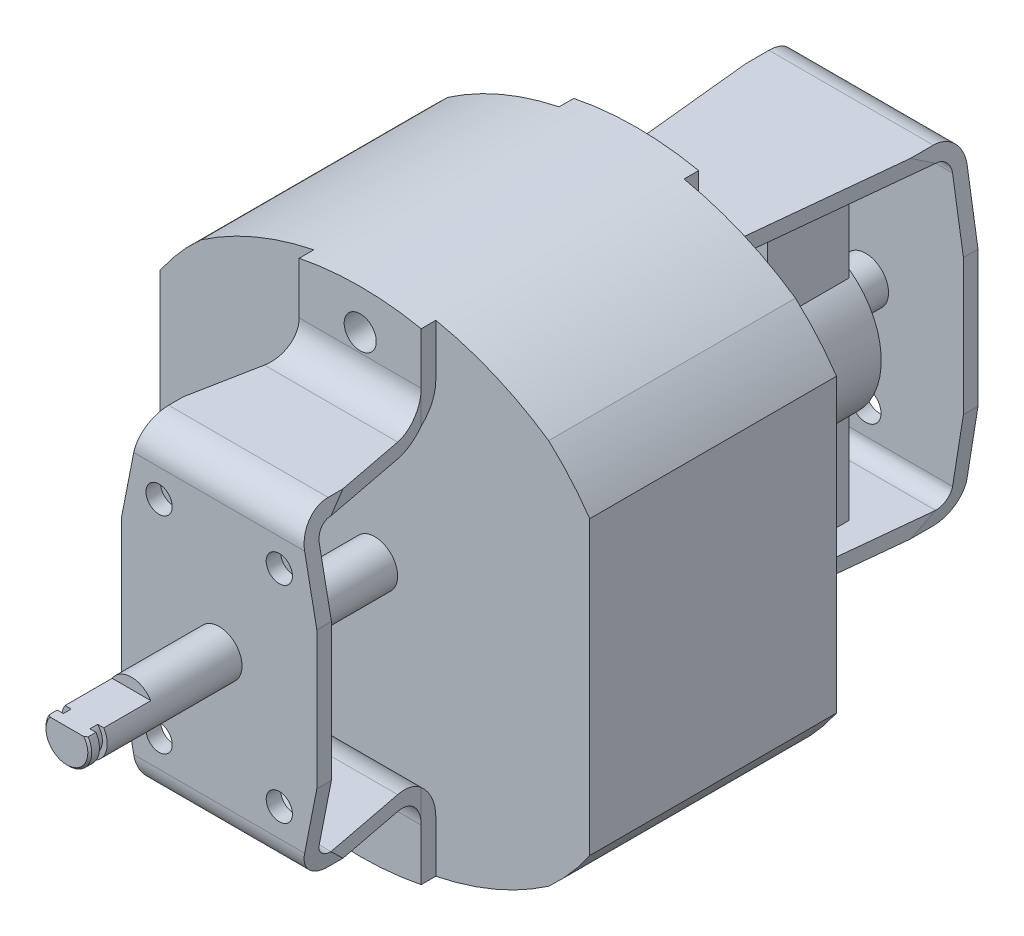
from build123d import *

# Parameters (mm, degrees)
MOTOR_CORE_DEPTH                   = 25.38
GEAR_END_PLATE_DEPTH               = 16
GEAR_END_PLATE_FILLET_R            = 3
GEAR_END_PLATE_CUT_DEPTH           = 59.513985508
SKETCH8_W                          = 12.55
SKETCH8_H                          = 9.5
GEAR_END_PLATE_TABS_DEPTH          = 1.5
GEAR_END_SIDE_CUT_DEPTH            = 64.300587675
GEAR_END_TAB_FILLET_R              = 3
GEAR_END_KLUDGE_FILLET_DEPTH       = 57.533596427
GEAR_END_KLUDGE_FILLET_DEPTH_BACK  = 57.533596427
GEAR_CADDY_SCREW_HOLES_REACH       = 55.659
SKETCH11_R                         = 1.35
ROTOR_END_PLATE_DEPTH              = 26.6
ROTOR_END_PLATE_FILLET_R           = 3
ROTOR_END_PLATE_CUT_DEPTH          = 59.519478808
ROTOR_END_PLATE_CUT_DEPTH_BACK     = 59.519478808
SKETCH15_W                         = 12.85
SKETCH15_H                         = 9
ROTOR_END_PLATE_TABS_DEPTH         = 1.5
ROTOR_END_SIDE_CT_DEPTH            = 64.637366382
ROTOR_END_SIDE_CT_DEPTH_BACK       = 64.637366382
ROTOR_END_TAB_FILLET_R             = 3
ROTOR_END_KLUDGE_FILLET_DEPTH      = 57.609032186
ROTOR_END_KLUDGE_FILLET_DEPTH_BACK = 57.609032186
MOTOR_LONG_SCREW_HOLES_DEPTH       = 54.659266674
MOTOR_LONG_SCREW_HOLES_DEPTH_BACK  = 54.659266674
SKETCH12_R                         = 1.65
MOTOR_SHAFT_DEPTH                  = 31.66
MOTOR_SHAFT_DEPTH_BACK             = 54.08
SKETCH1_R                          = 2.35
SKETCH3_R                          = 2.35
SKETCH3_R_2                        = 1.85
GROOVE_CUT_DEPTH                   = 1.8
SKETCH4_R                          = 2.35
GROOVE_FILL_DEPTH                  = 1
SHAFT_CHAMFER_SIZE                 = 0.2
MOTOR_GEAR_FLAT_DEPTH              = 6.64
ROTOR_END_PLATE_HOLES_REACH        = 92.347
SKETCH18_R                         = 1.58
MOTOR_START                        = -12
SKETCH20_R                         = 8
SKETCH20_R_2                       = 2.35
MOTOR_ROTOR_DEPTH                  = 12
MOTOR_START_2                      = -32.4
SKETCH21_W                         = 10.27446139
SKETCH21_H                         = 8.38731542
MOTOR_STATOR_BRUSHES_DEPTH         = 30.9
CUT_EXTRUDE1_DEPTH                 = 66.239166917


with BuildPart() as part:
    # motor core shape → motor core (new body)
    with BuildSketch(Plane.XY):
        with BuildLine():
            Line((-5.899788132, 26.05), (5.899788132, 26.05))
            ThreePointArc((5.899788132, 26.05), (15.050669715, 22.065523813), (22.1, 15))
            Line((22.1, 15), (22.1, -15))
            ThreePointArc((22.1, -15), (15.050669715, -22.065523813), (5.899788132, -26.05))
            Line((5.899788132, -26.05), (-5.899788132, -26.05))
            ThreePointArc((-5.899788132, -26.05), (-15.050669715, -22.065523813), (-22.1, -15))
            Line((-22.1, -15), (-22.1, 15))
            ThreePointArc((-22.1, 15), (-15.050669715, 22.065523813), (-5.899788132, 26.05))
        make_face()
    extrude(amount=MOTOR_CORE_DEPTH)

    # Sketch5 → gear end plate (add)
    with BuildSketch(Plane.XY.offset(25.38)):
        Polygon((8.2, 16.45), (10.04, 7.075), (10.04, -7.075), (8.2, -16.45), (-8.2, -16.45), (-10.04, -7.075), (-10.04, 7.075), (-8.2, 16.45), align=None)
    extrude(amount=GEAR_END_PLATE_DEPTH)

    # gear end plate fillet
    gear_end_plate_fillet_edges = [part.edges().sort_by_distance(p)[0] for p in [
        (0, 16.45, 41.38),
        (0, -16.45, 41.38),
    ]]
    fillet(gear_end_plate_fillet_edges, radius=GEAR_END_PLATE_FILLET_R)

    # Sketch7 → gear end plate cut (cut, through all)
    with BuildSketch(Plane.ZY.offset(10.04)):
        with BuildLine():
            Line((25.38, 14.95), (25.38, -14.95))
            Line((25.38, -14.95), (38.38, -14.95))
            ThreePointArc((38.38, -14.95), (39.440660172, -14.510660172), (39.88, -13.45))
            Line((39.88, -13.45), (39.88, -7.075))
            Line((39.88, -7.075), (39.88, 7.075))
            Line((39.88, 7.075), (39.88, 13.45))
            ThreePointArc((39.88, 13.45), (39.440660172, 14.510660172), (38.38, 14.95))
            Line((38.38, 14.95), (25.38, 14.95))
        make_face()
    extrude(amount=-GEAR_END_PLATE_CUT_DEPTH, mode=Mode.SUBTRACT)

    # Sketch8 → gear end plate tabs (add)
    with BuildSketch(Plane.XY.offset(25.38)):
        with Locations((0, 21.2)):
            Rectangle(SKETCH8_W, SKETCH8_H)
        with Locations((0, -21.2)):
            Rectangle(SKETCH8_W, SKETCH8_H)
    extrude(amount=GEAR_END_PLATE_TABS_DEPTH)

    # Sketch9 → gear end side cut (cut, through all)
    with BuildSketch(Plane.XZ.offset(16.45)):
        Polygon((-8.4944, 25.38), (-6.275, 25.38), (-6.275, 26.88), (-8.4944, 38.38), align=None)
        Polygon((6.275, 25.38), (8.4944, 25.38), (8.4944, 38.38), (6.275, 26.88), align=None)
    extrude(amount=-GEAR_END_SIDE_CUT_DEPTH, mode=Mode.SUBTRACT)

    # gear end tab fillet
    gear_end_tab_fillet_edges = [part.edges().sort_by_distance(p)[0] for p in [
        (0, -16.45, 26.88),
        (0, 16.45, 26.88),
    ]]
    fillet(gear_end_tab_fillet_edges, radius=GEAR_END_TAB_FILLET_R)

    # Sketch10 → gear end kludge fillet (cut, two sides: drawn at the far end of the back side and taken through both)
    with BuildSketch(Plane.ZY.offset(6.275).offset(-GEAR_END_KLUDGE_FILLET_DEPTH_BACK)):
        with BuildLine():
            Line((25.38, 19.45), (25.38, 14.95))
            Line((25.38, 14.95), (29.88, 14.95))
            ThreePointArc((29.88, 14.95), (26.698019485, 16.268019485), (25.38, 19.45))
        make_face()
        with BuildLine():
            Line((29.88, -14.95), (25.38, -14.95))
            Line((25.38, -14.95), (25.38, -19.45))
            ThreePointArc((25.38, -19.45), (26.698019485, -16.268019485), (29.88, -14.95))
        make_face()
    extrude(amount=GEAR_END_KLUDGE_FILLET_DEPTH + GEAR_END_KLUDGE_FILLET_DEPTH_BACK, mode=Mode.SUBTRACT)

    # Sketch11 → gear caddy screw holes (cut, up to next)
    with BuildSketch(Plane.XY.offset(41.38), mode=Mode.PRIVATE) as gear_caddy_screw_holes_sk1:
        with Locations((6.182497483, 10.598567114)):
            Circle(SKETCH11_R)
    gear_caddy_screw_holes_tool1 = extrude(gear_caddy_screw_holes_sk1.sketch, amount=-GEAR_CADDY_SCREW_HOLES_REACH, mode=Mode.PRIVATE) & part.part
    # Sketch11 → gear caddy screw holes (cut, up to next)
    with BuildSketch(Plane.XY.offset(41.38), mode=Mode.PRIVATE) as gear_caddy_screw_holes_sk2:
        with Locations(Location((-6.182497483, 10.598567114, 0), (0, 0, 180))):
            Circle(SKETCH11_R)
    gear_caddy_screw_holes_tool2 = extrude(gear_caddy_screw_holes_sk2.sketch, amount=-GEAR_CADDY_SCREW_HOLES_REACH, mode=Mode.PRIVATE) & part.part
    # Sketch11 → gear caddy screw holes (cut, up to next)
    with BuildSketch(Plane.XY.offset(41.38), mode=Mode.PRIVATE) as gear_caddy_screw_holes_sk3:
        with Locations((-6.182497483, -10.598567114)):
            Circle(SKETCH11_R)
    gear_caddy_screw_holes_tool3 = extrude(gear_caddy_screw_holes_sk3.sketch, amount=-GEAR_CADDY_SCREW_HOLES_REACH, mode=Mode.PRIVATE) & part.part
    # Sketch11 → gear caddy screw holes (cut, up to next)
    with BuildSketch(Plane.XY.offset(41.38), mode=Mode.PRIVATE) as gear_caddy_screw_holes_sk4:
        with Locations(Location((6.182497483, -10.598567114, 0), (0, 0, 180))):
            Circle(SKETCH11_R)
    gear_caddy_screw_holes_tool4 = extrude(gear_caddy_screw_holes_sk4.sketch, amount=-GEAR_CADDY_SCREW_HOLES_REACH, mode=Mode.PRIVATE) & part.part
    add(gear_caddy_screw_holes_tool1.solids().sort_by_distance((6.182497, 10.598567, 41.38))[0], mode=Mode.SUBTRACT)
    add(gear_caddy_screw_holes_tool2.solids().sort_by_distance((-6.182497, 10.598567, 41.38))[0], mode=Mode.SUBTRACT)
    add(gear_caddy_screw_holes_tool3.solids().sort_by_distance((-6.182497, -10.598567, 41.38))[0], mode=Mode.SUBTRACT)
    add(gear_caddy_screw_holes_tool4.solids().sort_by_distance((6.182497, -10.598567, 41.38))[0], mode=Mode.SUBTRACT)

    # Sketch13 → rotor end plate (add)
    with BuildSketch(Plane(origin=(0, 0, 0), x_dir=(-1, 0, 0), z_dir=(0, 0, -1))):
        Polygon((-8.45, 16.95), (8.45, 16.95), (10.05, 7), (10.05, -7), (8.45, -16.95), (-8.45, -16.95), (-10.05, -7), (-10.05, 7), align=None)
    extrude(amount=ROTOR_END_PLATE_DEPTH)

    # rotor end plate fillet
    rotor_end_plate_fillet_edges = [part.edges().sort_by_distance(p)[0] for p in [
        (0, 16.95, -26.6),
        (0, -16.95, -26.6),
    ]]
    fillet(rotor_end_plate_fillet_edges, radius=ROTOR_END_PLATE_FILLET_R)

    # Sketch14 → rotor end plate cut (cut, two sides: drawn at the far end of the back side and taken through both)
    with BuildSketch(Plane(origin=(10.05, 0, 0), x_dir=(0, 0, -1), z_dir=(1, 0, 0)).offset(-ROTOR_END_PLATE_CUT_DEPTH_BACK)):
        with BuildLine():
            Line((0, -15.45), (0, 15.45))
            Line((0, 15.45), (23.6, 15.45))
            ThreePointArc((23.6, 15.45), (24.660660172, 15.010660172), (25.1, 13.95))
            Line((25.1, 13.95), (25.1, 7))
            Line((25.1, 7), (25.1, -7))
            Line((25.1, -7), (25.1, -13.95))
            ThreePointArc((25.1, -13.95), (24.660660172, -15.010660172), (23.6, -15.45))
            Line((23.6, -15.45), (0, -15.45))
        make_face()
    extrude(amount=ROTOR_END_PLATE_CUT_DEPTH + ROTOR_END_PLATE_CUT_DEPTH_BACK, mode=Mode.SUBTRACT)

    # Sketch15 → rotor end plate tabs (add)
    with BuildSketch(Plane(origin=(0, 0, 0), x_dir=(-1, 0, 0), z_dir=(0, 0, -1))):
        with Locations((0, 21.45)):
            Rectangle(SKETCH15_W, SKETCH15_H)
        with Locations((0, -21.45)):
            Rectangle(SKETCH15_W, SKETCH15_H)
    extrude(amount=ROTOR_END_PLATE_TABS_DEPTH)

    # Sketch16 → rotor end side ct (cut, two sides: drawn at the far end of the back side and taken through both)
    with BuildSketch(Plane.XZ.offset(16.95).offset(-ROTOR_END_SIDE_CT_DEPTH_BACK)):
        Polygon((-8.69120603, -23.6), (-8.69120603, 0), (-6.425, 0), (-6.425, -1.5), align=None)
        Polygon((6.425, -1.5), (6.425, 0), (8.69120603, 0), (8.69120603, -23.6), align=None)
    extrude(amount=ROTOR_END_SIDE_CT_DEPTH + ROTOR_END_SIDE_CT_DEPTH_BACK, mode=Mode.SUBTRACT)

    # rotor end tab fillet
    rotor_end_tab_fillet_edges = [part.edges().sort_by_distance(p)[0] for p in [
        (0, -16.95, -1.5),
        (0, 16.95, -1.5),
    ]]
    fillet(rotor_end_tab_fillet_edges, radius=ROTOR_END_TAB_FILLET_R)

    # Sketch17 → rotor end kludge fillet (cut, two sides: drawn at the far end of the back side and taken through both)
    with BuildSketch(Plane.ZY.offset(6.425).offset(-ROTOR_END_KLUDGE_FILLET_DEPTH_BACK)):
        with BuildLine():
            Line((0, 19.95), (0, 15.45))
            Line((0, 15.45), (-4.5, 15.45))
            ThreePointArc((-4.5, 15.45), (-1.318019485, 16.768019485), (0, 19.95))
        make_face()
        with BuildLine():
            Line((0, -19.95), (0, -15.45))
            Line((0, -15.45), (-4.5, -15.45))
            ThreePointArc((-4.5, -15.45), (-1.318019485, -16.768019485), (0, -19.95))
        make_face()
    extrude(amount=ROTOR_END_KLUDGE_FILLET_DEPTH + ROTOR_END_KLUDGE_FILLET_DEPTH_BACK, mode=Mode.SUBTRACT)

    # Sketch12 → motor long screw holes (cut, two sides: drawn at the far end of the back side and taken through both)
    with BuildSketch(Plane(origin=(0, 0, 0), x_dir=(-1, 0, 0), z_dir=(0, 0, -1)).offset(-MOTOR_LONG_SCREW_HOLES_DEPTH_BACK)):
        with Locations(Location((0, 21.3, 0), (0, 0, 305.096801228))):
            Circle(SKETCH12_R)
        with Locations((0, -21.3)):
            Circle(SKETCH12_R)
    extrude(amount=MOTOR_LONG_SCREW_HOLES_DEPTH + MOTOR_LONG_SCREW_HOLES_DEPTH_BACK, mode=Mode.SUBTRACT)

    # Sketch1 → motor shaft (add, two sides: drawn at the far end of the back side and taken through both)
    with BuildSketch(Plane.XY.offset(25.38).offset(-MOTOR_SHAFT_DEPTH_BACK)):
        Circle(SKETCH1_R)
    extrude(amount=MOTOR_SHAFT_DEPTH + MOTOR_SHAFT_DEPTH_BACK)

    # Sketch3 → groove cut (cut)
    with BuildSketch(Plane.XY.offset(57.04)):
        with Locations(Location((0, 0, 0), (0, 0, 180))):
            Circle(SKETCH3_R)
        Circle(SKETCH3_R_2, mode=Mode.SUBTRACT)
    extrude(amount=-GROOVE_CUT_DEPTH, mode=Mode.SUBTRACT)

    # Sketch4 → groove fill (add)
    with BuildSketch(Plane.XY.offset(57.04)):
        with Locations(Location((0, 0, 0), (0, 0, 180))):
            Circle(SKETCH4_R)
    extrude(amount=-GROOVE_FILL_DEPTH)

    # shaft chamfer
    shaft_chamfer_edges = [part.edges().sort_by_distance(p)[0] for p in [
        (2.35, 0, 57.04),
    ]]
    chamfer(shaft_chamfer_edges, length=SHAFT_CHAMFER_SIZE)

    # Sketch2 → motor gear flat (cut)
    with BuildSketch(Plane.XY.offset(57.04)):
        with BuildLine():
            Line((-1.989974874, 1.25), (1.989974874, 1.25))
            ThreePointArc((1.989974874, 1.25), (0, 2.35), (-1.989974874, 1.25))
        make_face()
    extrude(amount=-MOTOR_GEAR_FLAT_DEPTH, mode=Mode.SUBTRACT)

    # Sketch18 → rotor end plate holes (cut, up to next)
    with BuildSketch(Plane(origin=(0, 0, -26.6), x_dir=(-1, 0, 0), z_dir=(0, 0, -1)), mode=Mode.PRIVATE) as rotor_end_plate_holes_sk1:
        with Locations((0, 11.12)):
            Circle(SKETCH18_R)
    rotor_end_plate_holes_tool1 = extrude(rotor_end_plate_holes_sk1.sketch, amount=-ROTOR_END_PLATE_HOLES_REACH, mode=Mode.PRIVATE) & part.part
    # Sketch18 → rotor end plate holes (cut, up to next)
    with BuildSketch(Plane(origin=(0, 0, -26.6), x_dir=(-1, 0, 0), z_dir=(0, 0, -1)), mode=Mode.PRIVATE) as rotor_end_plate_holes_sk2:
        with Locations(Location((0, -11.12, 0), (0, 0, 180))):
            Circle(SKETCH18_R)
    rotor_end_plate_holes_tool2 = extrude(rotor_end_plate_holes_sk2.sketch, amount=-ROTOR_END_PLATE_HOLES_REACH, mode=Mode.PRIVATE) & part.part
    add(rotor_end_plate_holes_tool1.solids().sort_by_distance((0, 11.12, -26.6))[0], mode=Mode.SUBTRACT)
    add(rotor_end_plate_holes_tool2.solids().sort_by_distance((0, -11.12, -26.6))[0], mode=Mode.SUBTRACT)

    # Sketch20 → motor rotor (add)
    with BuildSketch(Plane(origin=(0, 0, -18.7), x_dir=(-1, 0, 0), z_dir=(0, 0, -1)).offset(MOTOR_START)):
        Circle(SKETCH20_R)
        Circle(SKETCH20_R_2, mode=Mode.SUBTRACT)
    extrude(amount=MOTOR_ROTOR_DEPTH)

    # Sketch21 → motor stator_brushes (add)
    with BuildSketch(Plane(origin=(0, 16.95, 0), x_dir=(-1, 0, 0), z_dir=(0, 1, 0)).offset(MOTOR_START_2)):
        with Locations((0, -14.052982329)):
            Rectangle(SKETCH21_W, SKETCH21_H)
    extrude(amount=MOTOR_STATOR_BRUSHES_DEPTH)

    # Sketch22 → Cut-Extrude1 (cut, through all)
    with BuildSketch(Plane.XY.offset(26.88)):
        with BuildLine():
            Line((-5.899788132, 26.05), (6.425, 25.925458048))
            ThreePointArc((6.425, 25.925458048), (12.52564942, 23.590635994), (17.877135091, 19.844849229))
            ThreePointArc((17.877135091, 19.844849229), (0, 25.385679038), (-17.877135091, 19.844849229))
            ThreePointArc((-17.877135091, 19.844849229), (-12.286638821, 23.715996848), (-5.899788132, 26.05))
        make_face()
        with BuildLine():
            Line((-5.899788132, -26.05), (6.425, -25.925458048))
            ThreePointArc((6.425, -25.925458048), (12.52564942, -23.590635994), (17.877135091, -19.844849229))
            ThreePointArc((17.877135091, -19.844849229), (0, -25.385679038), (-17.877135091, -19.844849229))
            ThreePointArc((-17.877135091, -19.844849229), (-12.286638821, -23.715996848), (-5.899788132, -26.05))
        make_face()
    extrude(amount=-CUT_EXTRUDE1_DEPTH, mode=Mode.SUBTRACT)


with BuildPart() as cut_extrude1_kept_piece:
    # of the separate pieces the step leaves, the one the design keeps (cut_extrude1_pieces_kept)
    add(part.part.solids().sort_by_distance((1.989974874, 1.25, 56.84))[0])


solid = cut_extrude1_kept_piece.part
